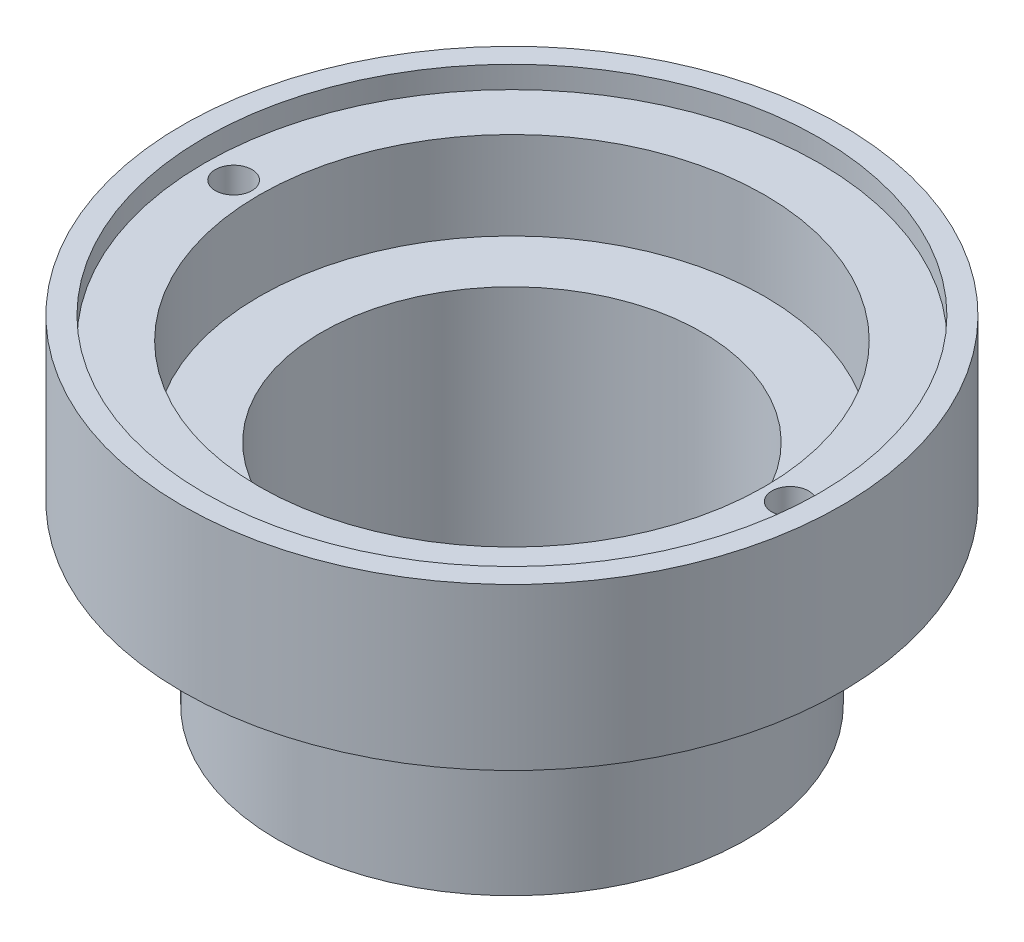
ISO-10303-21;
HEADER;
FILE_DESCRIPTION(('STEP AP214'),'2;1');
FILE_NAME('part.step','',(''),(''),'','','');
FILE_SCHEMA(('AUTOMOTIVE_DESIGN { 1 0 10303 214 1 1 1 1 }'));
ENDSEC;
DATA;
#1=APPLICATION_CONTEXT('core data for automotive mechanical design processes');
#2=APPLICATION_PROTOCOL_DEFINITION('international standard','automotive_design',2000,#1);
#3=PRODUCT_CONTEXT('',#1,'mechanical');
#4=PRODUCT('Part','Part','',(#3));
#5=PRODUCT_RELATED_PRODUCT_CATEGORY('part','',(#4));
#6=PRODUCT_DEFINITION_FORMATION('','',#4);
#7=PRODUCT_DEFINITION_CONTEXT('part definition',#1,'design');
#8=PRODUCT_DEFINITION('design','',#6,#7);
#9=PRODUCT_DEFINITION_SHAPE('','',#8);
#10=(LENGTH_UNIT() NAMED_UNIT(*) SI_UNIT(.MILLI.,.METRE.));
#11=(NAMED_UNIT(*) PLANE_ANGLE_UNIT() SI_UNIT($,.RADIAN.));
#12=(NAMED_UNIT(*) SI_UNIT($,.STERADIAN.) SOLID_ANGLE_UNIT());
#13=UNCERTAINTY_MEASURE_WITH_UNIT(LENGTH_MEASURE(1.E-05),#10,'distance_accuracy_value','');
#14=(GEOMETRIC_REPRESENTATION_CONTEXT(3) GLOBAL_UNCERTAINTY_ASSIGNED_CONTEXT((#13)) GLOBAL_UNIT_ASSIGNED_CONTEXT((#10,
#11,#12)) REPRESENTATION_CONTEXT('',''));
#15=CARTESIAN_POINT('',(0.,0.,0.));
#16=DIRECTION('',(0.,0.,1.));
#17=DIRECTION('',(1.,0.,0.));
#18=AXIS2_PLACEMENT_3D('',#15,#16,#17);
#19=CARTESIAN_POINT('',(0.,15.5,0.));
#20=DIRECTION('',(0.,1.,0.));
#21=DIRECTION('',(0.,0.,1.));
#22=AXIS2_PLACEMENT_3D('',#19,#20,#21);
#23=PLANE('',#22);
#24=CARTESIAN_POINT('',(0.,15.5,0.));
#25=DIRECTION('',(0.,1.,0.));
#26=DIRECTION('',(0.,0.,1.));
#27=AXIS2_PLACEMENT_3D('',#24,#25,#26);
#28=CIRCLE('',#27,17.25);
#29=CARTESIAN_POINT('',(0.,15.5,17.25));
#30=VERTEX_POINT('',#29);
#31=EDGE_CURVE('E57',#30,#30,#28,.T.);
#32=ORIENTED_EDGE('',*,*,#31,.T.);
#33=EDGE_LOOP('',(#32));
#34=FACE_BOUND('',#33,.T.);
#35=CARTESIAN_POINT('',(0.,15.5,0.));
#36=DIRECTION('',(0.,1.,0.));
#37=DIRECTION('',(0.,0.,1.));
#38=AXIS2_PLACEMENT_3D('',#35,#36,#37);
#39=CIRCLE('',#38,13.);
#40=CARTESIAN_POINT('',(0.,15.5,13.));
#41=VERTEX_POINT('',#40);
#42=EDGE_CURVE('E17',#41,#41,#39,.F.);
#43=ORIENTED_EDGE('',*,*,#42,.T.);
#44=EDGE_LOOP('',(#43));
#45=FACE_BOUND('',#44,.T.);
#46=ADVANCED_FACE('F14',(#34,#45),#23,.T.);
#47=CARTESIAN_POINT('',(0.,-1.14999999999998,0.));
#48=DIRECTION('',(0.,1.,0.));
#49=DIRECTION('',(0.,0.,1.));
#50=AXIS2_PLACEMENT_3D('',#47,#48,#49);
#51=CYLINDRICAL_SURFACE('',#50,13.);
#52=ORIENTED_EDGE('',*,*,#42,.F.);
#53=EDGE_LOOP('',(#52));
#54=FACE_BOUND('',#53,.T.);
#55=CARTESIAN_POINT('',(0.,0.,0.));
#56=DIRECTION('',(0.,1.,0.));
#57=DIRECTION('',(0.,0.,1.));
#58=AXIS2_PLACEMENT_3D('',#55,#56,#57);
#59=CIRCLE('',#58,13.);
#60=CARTESIAN_POINT('',(0.,0.,13.));
#61=VERTEX_POINT('',#60);
#62=EDGE_CURVE('E55',#61,#61,#59,.F.);
#63=ORIENTED_EDGE('',*,*,#62,.T.);
#64=EDGE_LOOP('',(#63));
#65=FACE_BOUND('',#64,.T.);
#66=ADVANCED_FACE('F65',(#54,#65),#51,.F.);
#67=CARTESIAN_POINT('',(0.,-1.14999999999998,0.));
#68=DIRECTION('',(0.,1.,0.));
#69=DIRECTION('',(0.,0.,1.));
#70=AXIS2_PLACEMENT_3D('',#67,#68,#69);
#71=CYLINDRICAL_SURFACE('',#70,17.25);
#72=ORIENTED_EDGE('',*,*,#31,.F.);
#73=EDGE_LOOP('',(#72));
#74=FACE_BOUND('',#73,.T.);
#75=CARTESIAN_POINT('',(0.,21.5,0.));
#76=DIRECTION('',(0.,1.,0.));
#77=DIRECTION('',(0.,0.,1.));
#78=AXIS2_PLACEMENT_3D('',#75,#76,#77);
#79=CIRCLE('',#78,17.25);
#80=CARTESIAN_POINT('',(0.,21.5,17.25));
#81=VERTEX_POINT('',#80);
#82=EDGE_CURVE('E52',#81,#81,#79,.F.);
#83=ORIENTED_EDGE('',*,*,#82,.F.);
#84=EDGE_LOOP('',(#83));
#85=FACE_BOUND('',#84,.T.);
#86=ADVANCED_FACE('F68',(#74,#85),#71,.F.);
#87=CARTESIAN_POINT('',(0.,0.,0.));
#88=DIRECTION('',(0.,1.,0.));
#89=DIRECTION('',(0.,0.,1.));
#90=AXIS2_PLACEMENT_3D('',#87,#88,#89);
#91=PLANE('',#90);
#92=CARTESIAN_POINT('',(0.,0.,0.));
#93=DIRECTION('',(0.,1.,0.));
#94=DIRECTION('',(0.,0.,1.));
#95=AXIS2_PLACEMENT_3D('',#92,#93,#94);
#96=CIRCLE('',#95,16.);
#97=CARTESIAN_POINT('',(0.,0.,16.));
#98=VERTEX_POINT('',#97);
#99=EDGE_CURVE('E46',#98,#98,#96,.T.);
#100=ORIENTED_EDGE('',*,*,#99,.F.);
#101=EDGE_LOOP('',(#100));
#102=FACE_BOUND('',#101,.T.);
#103=ORIENTED_EDGE('',*,*,#62,.F.);
#104=EDGE_LOOP('',(#103));
#105=FACE_BOUND('',#104,.T.);
#106=ADVANCED_FACE('F71',(#102,#105),#91,.F.);
#107=CARTESIAN_POINT('',(0.,21.5,0.));
#108=DIRECTION('',(0.,1.,0.));
#109=DIRECTION('',(0.,0.,1.));
#110=AXIS2_PLACEMENT_3D('',#107,#108,#109);
#111=PLANE('',#110);
#112=CARTESIAN_POINT('',(0.,21.5,0.));
#113=DIRECTION('',(0.,1.,0.));
#114=DIRECTION('',(0.,0.,1.));
#115=AXIS2_PLACEMENT_3D('',#112,#113,#114);
#116=CIRCLE('',#115,21.);
#117=CARTESIAN_POINT('',(0.,21.5,21.));
#118=VERTEX_POINT('',#117);
#119=EDGE_CURVE('E40',#118,#118,#116,.T.);
#120=ORIENTED_EDGE('',*,*,#119,.T.);
#121=EDGE_LOOP('',(#120));
#122=FACE_BOUND('',#121,.T.);
#123=CARTESIAN_POINT('',(-19.,21.5,0.));
#124=DIRECTION('',(0.,-1.,0.));
#125=DIRECTION('',(0.,0.,-1.));
#126=AXIS2_PLACEMENT_3D('',#123,#124,#125);
#127=CIRCLE('',#126,1.25);
#128=CARTESIAN_POINT('',(-19.,21.5,-1.24999999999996));
#129=VERTEX_POINT('',#128);
#130=EDGE_CURVE('E43',#129,#129,#127,.T.);
#131=ORIENTED_EDGE('',*,*,#130,.T.);
#132=EDGE_LOOP('',(#131));
#133=FACE_BOUND('',#132,.T.);
#134=ORIENTED_EDGE('',*,*,#82,.T.);
#135=EDGE_LOOP('',(#134));
#136=FACE_BOUND('',#135,.T.);
#137=CARTESIAN_POINT('',(19.,21.5,0.));
#138=DIRECTION('',(0.,-1.,0.));
#139=DIRECTION('',(0.,0.,-1.));
#140=AXIS2_PLACEMENT_3D('',#137,#138,#139);
#141=CIRCLE('',#140,1.25);
#142=CARTESIAN_POINT('',(19.,21.5,-1.24999999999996));
#143=VERTEX_POINT('',#142);
#144=EDGE_CURVE('E49',#143,#143,#141,.T.);
#145=ORIENTED_EDGE('',*,*,#144,.T.);
#146=EDGE_LOOP('',(#145));
#147=FACE_BOUND('',#146,.T.);
#148=ADVANCED_FACE('F73',(#122,#133,#136,#147),#111,.T.);
#149=CARTESIAN_POINT('',(19.,21.5,0.));
#150=DIRECTION('',(0.,-1.,0.));
#151=DIRECTION('',(0.,0.,-1.));
#152=AXIS2_PLACEMENT_3D('',#149,#150,#151);
#153=CYLINDRICAL_SURFACE('',#152,1.25);
#154=ORIENTED_EDGE('',*,*,#144,.F.);
#155=EDGE_LOOP('',(#154));
#156=FACE_BOUND('',#155,.T.);
#157=CARTESIAN_POINT('',(19.,12.,0.));
#158=DIRECTION('',(0.,-1.,0.));
#159=DIRECTION('',(0.,0.,-1.));
#160=AXIS2_PLACEMENT_3D('',#157,#158,#159);
#161=CIRCLE('',#160,1.25);
#162=CARTESIAN_POINT('',(19.,12.,-1.24999999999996));
#163=VERTEX_POINT('',#162);
#164=EDGE_CURVE('E37',#163,#163,#161,.T.);
#165=ORIENTED_EDGE('',*,*,#164,.T.);
#166=EDGE_LOOP('',(#165));
#167=FACE_BOUND('',#166,.T.);
#168=ADVANCED_FACE('F81',(#156,#167),#153,.F.);
#169=CARTESIAN_POINT('',(0.,-1.14999999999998,0.));
#170=DIRECTION('',(0.,1.,0.));
#171=DIRECTION('',(0.,0.,1.));
#172=AXIS2_PLACEMENT_3D('',#169,#170,#171);
#173=CYLINDRICAL_SURFACE('',#172,16.);
#174=ORIENTED_EDGE('',*,*,#99,.T.);
#175=EDGE_LOOP('',(#174));
#176=FACE_BOUND('',#175,.T.);
#177=CARTESIAN_POINT('',(0.,12.,0.));
#178=DIRECTION('',(0.,1.,0.));
#179=DIRECTION('',(0.,0.,1.));
#180=AXIS2_PLACEMENT_3D('',#177,#178,#179);
#181=CIRCLE('',#180,16.);
#182=CARTESIAN_POINT('',(0.,12.,16.));
#183=VERTEX_POINT('',#182);
#184=EDGE_CURVE('E34',#183,#183,#181,.F.);
#185=ORIENTED_EDGE('',*,*,#184,.T.);
#186=EDGE_LOOP('',(#185));
#187=FACE_BOUND('',#186,.T.);
#188=ADVANCED_FACE('F109',(#176,#187),#173,.T.);
#189=CARTESIAN_POINT('',(-19.,21.5,0.));
#190=DIRECTION('',(0.,-1.,0.));
#191=DIRECTION('',(0.,0.,-1.));
#192=AXIS2_PLACEMENT_3D('',#189,#190,#191);
#193=CYLINDRICAL_SURFACE('',#192,1.25);
#194=ORIENTED_EDGE('',*,*,#130,.F.);
#195=EDGE_LOOP('',(#194));
#196=FACE_BOUND('',#195,.T.);
#197=CARTESIAN_POINT('',(-19.,12.,0.));
#198=DIRECTION('',(0.,-1.,0.));
#199=DIRECTION('',(0.,0.,-1.));
#200=AXIS2_PLACEMENT_3D('',#197,#198,#199);
#201=CIRCLE('',#200,1.25);
#202=CARTESIAN_POINT('',(-19.,12.,-1.24999999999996));
#203=VERTEX_POINT('',#202);
#204=EDGE_CURVE('E31',#203,#203,#201,.T.);
#205=ORIENTED_EDGE('',*,*,#204,.T.);
#206=EDGE_LOOP('',(#205));
#207=FACE_BOUND('',#206,.T.);
#208=ADVANCED_FACE('F105',(#196,#207),#193,.F.);
#209=CARTESIAN_POINT('',(0.,-1.14999999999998,0.));
#210=DIRECTION('',(0.,1.,0.));
#211=DIRECTION('',(0.,0.,1.));
#212=AXIS2_PLACEMENT_3D('',#209,#210,#211);
#213=CYLINDRICAL_SURFACE('',#212,21.);
#214=ORIENTED_EDGE('',*,*,#119,.F.);
#215=EDGE_LOOP('',(#214));
#216=FACE_BOUND('',#215,.T.);
#217=CARTESIAN_POINT('',(0.,23.,0.));
#218=DIRECTION('',(0.,1.,0.));
#219=DIRECTION('',(0.,0.,1.));
#220=AXIS2_PLACEMENT_3D('',#217,#218,#219);
#221=CIRCLE('',#220,21.);
#222=CARTESIAN_POINT('',(0.,23.,21.));
#223=VERTEX_POINT('',#222);
#224=EDGE_CURVE('E26',#223,#223,#221,.F.);
#225=ORIENTED_EDGE('',*,*,#224,.F.);
#226=EDGE_LOOP('',(#225));
#227=FACE_BOUND('',#226,.T.);
#228=ADVANCED_FACE('F101',(#216,#227),#213,.F.);
#229=CARTESIAN_POINT('',(0.,12.,0.));
#230=DIRECTION('',(0.,1.,0.));
#231=DIRECTION('',(0.,0.,1.));
#232=AXIS2_PLACEMENT_3D('',#229,#230,#231);
#233=PLANE('',#232);
#234=CARTESIAN_POINT('',(0.,12.,0.));
#235=DIRECTION('',(0.,1.,0.));
#236=DIRECTION('',(0.,0.,1.));
#237=AXIS2_PLACEMENT_3D('',#234,#235,#236);
#238=CIRCLE('',#237,22.5);
#239=CARTESIAN_POINT('',(0.,12.,22.5));
#240=VERTEX_POINT('',#239);
#241=EDGE_CURVE('E21',#240,#240,#238,.T.);
#242=ORIENTED_EDGE('',*,*,#241,.F.);
#243=EDGE_LOOP('',(#242));
#244=FACE_BOUND('',#243,.T.);
#245=ORIENTED_EDGE('',*,*,#204,.F.);
#246=EDGE_LOOP('',(#245));
#247=FACE_BOUND('',#246,.T.);
#248=ORIENTED_EDGE('',*,*,#184,.F.);
#249=EDGE_LOOP('',(#248));
#250=FACE_BOUND('',#249,.T.);
#251=ORIENTED_EDGE('',*,*,#164,.F.);
#252=EDGE_LOOP('',(#251));
#253=FACE_BOUND('',#252,.T.);
#254=ADVANCED_FACE('F94',(#244,#247,#250,#253),#233,.F.);
#255=CARTESIAN_POINT('',(0.,23.,0.));
#256=DIRECTION('',(0.,1.,0.));
#257=DIRECTION('',(0.,0.,1.));
#258=AXIS2_PLACEMENT_3D('',#255,#256,#257);
#259=PLANE('',#258);
#260=CARTESIAN_POINT('',(0.,23.,0.));
#261=DIRECTION('',(0.,1.,0.));
#262=DIRECTION('',(0.,0.,1.));
#263=AXIS2_PLACEMENT_3D('',#260,#261,#262);
#264=CIRCLE('',#263,22.5);
#265=CARTESIAN_POINT('',(0.,23.,22.5));
#266=VERTEX_POINT('',#265);
#267=EDGE_CURVE('E10',#266,#266,#264,.F.);
#268=ORIENTED_EDGE('',*,*,#267,.F.);
#269=EDGE_LOOP('',(#268));
#270=FACE_BOUND('',#269,.T.);
#271=ORIENTED_EDGE('',*,*,#224,.T.);
#272=EDGE_LOOP('',(#271));
#273=FACE_BOUND('',#272,.T.);
#274=ADVANCED_FACE('F89',(#270,#273),#259,.T.);
#275=CARTESIAN_POINT('',(0.,-1.14999999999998,0.));
#276=DIRECTION('',(0.,1.,0.));
#277=DIRECTION('',(0.,0.,1.));
#278=AXIS2_PLACEMENT_3D('',#275,#276,#277);
#279=CYLINDRICAL_SURFACE('',#278,22.5);
#280=ORIENTED_EDGE('',*,*,#267,.T.);
#281=EDGE_LOOP('',(#280));
#282=FACE_BOUND('',#281,.T.);
#283=ORIENTED_EDGE('',*,*,#241,.T.);
#284=EDGE_LOOP('',(#283));
#285=FACE_BOUND('',#284,.T.);
#286=ADVANCED_FACE('F87',(#282,#285),#279,.T.);
#287=CLOSED_SHELL('',(#46,#66,#86,#106,#148,#168,#188,#208,#228,#254,#274,#286));
#288=MANIFOLD_SOLID_BREP('B1',#287);
#289=ADVANCED_BREP_SHAPE_REPRESENTATION('',(#18,#288),#14);
#290=SHAPE_DEFINITION_REPRESENTATION(#9,#289);
ENDSEC;
END-ISO-10303-21;
